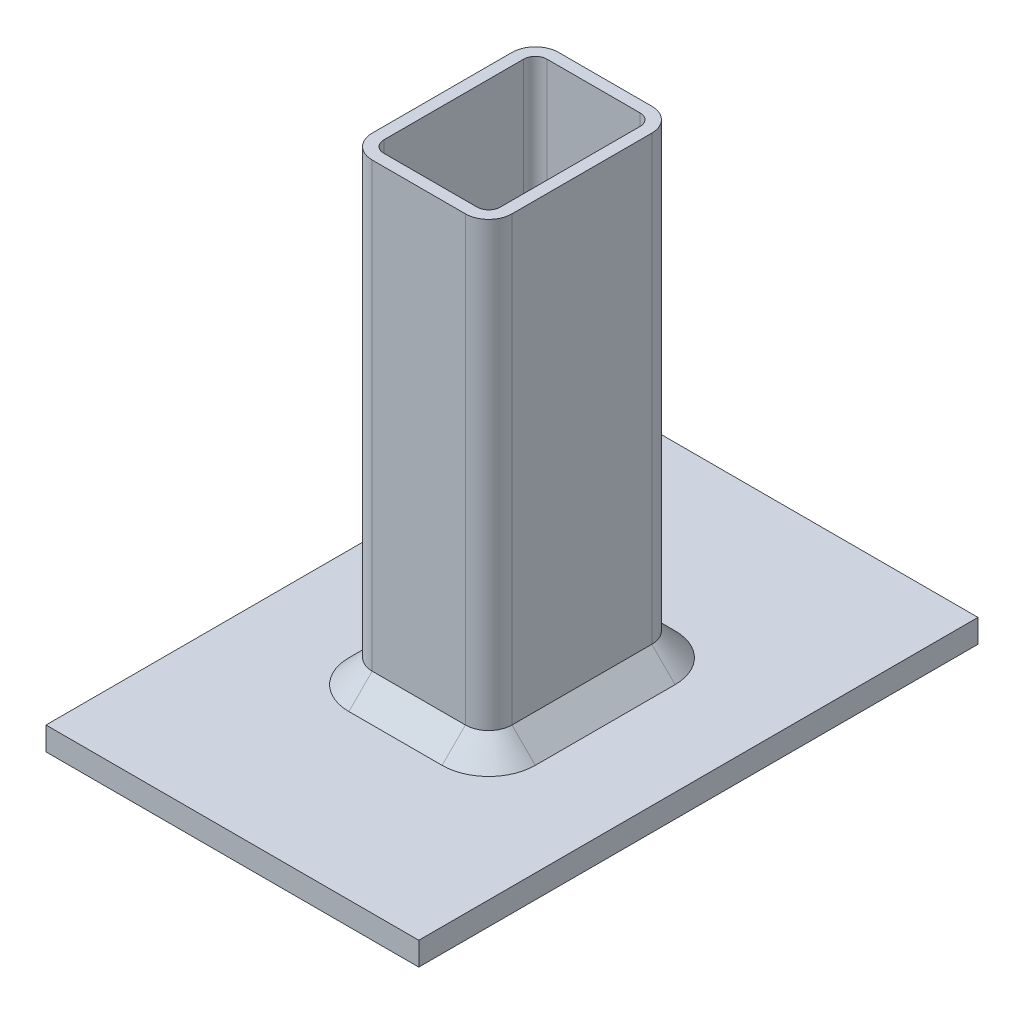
ISO-10303-21;
HEADER;
FILE_DESCRIPTION(('STEP AP214'),'2;1');
FILE_NAME('part.step','',(''),(''),'','','');
FILE_SCHEMA(('AUTOMOTIVE_DESIGN { 1 0 10303 214 1 1 1 1 }'));
ENDSEC;
DATA;
#1=APPLICATION_CONTEXT('core data for automotive mechanical design processes');
#2=APPLICATION_PROTOCOL_DEFINITION('international standard','automotive_design',2000,#1);
#3=PRODUCT_CONTEXT('',#1,'mechanical');
#4=PRODUCT('Part','Part','',(#3));
#5=PRODUCT_RELATED_PRODUCT_CATEGORY('part','',(#4));
#6=PRODUCT_DEFINITION_FORMATION('','',#4);
#7=PRODUCT_DEFINITION_CONTEXT('part definition',#1,'design');
#8=PRODUCT_DEFINITION('design','',#6,#7);
#9=PRODUCT_DEFINITION_SHAPE('','',#8);
#10=(LENGTH_UNIT() NAMED_UNIT(*) SI_UNIT(.MILLI.,.METRE.));
#11=(NAMED_UNIT(*) PLANE_ANGLE_UNIT() SI_UNIT($,.RADIAN.));
#12=(NAMED_UNIT(*) SI_UNIT($,.STERADIAN.) SOLID_ANGLE_UNIT());
#13=UNCERTAINTY_MEASURE_WITH_UNIT(LENGTH_MEASURE(1.E-05),#10,'distance_accuracy_value','');
#14=(GEOMETRIC_REPRESENTATION_CONTEXT(3) GLOBAL_UNCERTAINTY_ASSIGNED_CONTEXT((#13)) GLOBAL_UNIT_ASSIGNED_CONTEXT((#10,
#11,#12)) REPRESENTATION_CONTEXT('',''));
#15=CARTESIAN_POINT('',(0.,0.,0.));
#16=DIRECTION('',(0.,0.,1.));
#17=DIRECTION('',(1.,0.,0.));
#18=AXIS2_PLACEMENT_3D('',#15,#16,#17);
#19=CARTESIAN_POINT('',(38.1,12.7,-38.1));
#20=DIRECTION('',(0.707106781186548,0.707106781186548,0.));
#21=DIRECTION('',(-0.707106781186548,0.707106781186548,0.));
#22=AXIS2_PLACEMENT_3D('',#19,#20,#21);
#23=PLANE('',#22);
#24=DIRECTION('',(-0.707106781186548,0.707106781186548,0.));
#25=VECTOR('',#24,1.);
#26=CARTESIAN_POINT('',(50.8,0.,38.1));
#27=LINE('',#26,#25);
#28=CARTESIAN_POINT('',(50.8,0.,38.1));
#29=VERTEX_POINT('',#28);
#30=CARTESIAN_POINT('',(38.1,12.7,38.1));
#31=VERTEX_POINT('',#30);
#32=EDGE_CURVE('E232',#29,#31,#27,.T.);
#33=ORIENTED_EDGE('',*,*,#32,.F.);
#34=DIRECTION('',(0.,0.,1.));
#35=VECTOR('',#34,1.);
#36=CARTESIAN_POINT('',(50.8,0.,38.1));
#37=LINE('',#36,#35);
#38=CARTESIAN_POINT('',(50.8,0.,-38.1));
#39=VERTEX_POINT('',#38);
#40=EDGE_CURVE('E191',#39,#29,#37,.T.);
#41=ORIENTED_EDGE('',*,*,#40,.F.);
#42=DIRECTION('',(0.707106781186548,-0.707106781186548,0.));
#43=VECTOR('',#42,1.);
#44=CARTESIAN_POINT('',(38.1,12.7,-38.1));
#45=LINE('',#44,#43);
#46=CARTESIAN_POINT('',(38.1,12.7,-38.1));
#47=VERTEX_POINT('',#46);
#48=EDGE_CURVE('E53',#47,#39,#45,.T.);
#49=ORIENTED_EDGE('',*,*,#48,.F.);
#50=DIRECTION('',(0.,0.,-1.));
#51=VECTOR('',#50,1.);
#52=CARTESIAN_POINT('',(38.1,12.7,-38.1));
#53=LINE('',#52,#51);
#54=EDGE_CURVE('E12',#31,#47,#53,.T.);
#55=ORIENTED_EDGE('',*,*,#54,.F.);
#56=EDGE_LOOP('',(#33,#41,#49,#55));
#57=FACE_BOUND('',#56,.T.);
#58=ADVANCED_FACE('F50',(#57),#23,.T.);
#59=CARTESIAN_POINT('',(25.4,12.7,-38.1));
#60=DIRECTION('',(0.,-1.,0.));
#61=DIRECTION('',(0.,0.,-1.));
#62=AXIS2_PLACEMENT_3D('',#59,#60,#61);
#63=CONICAL_SURFACE('',#62,12.7,0.785398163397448);
#64=ORIENTED_EDGE('',*,*,#48,.T.);
#65=CARTESIAN_POINT('',(25.4,0.,-38.1));
#66=DIRECTION('',(0.,-1.,0.));
#67=DIRECTION('',(0.,0.,-1.));
#68=AXIS2_PLACEMENT_3D('',#65,#66,#67);
#69=CIRCLE('',#68,25.4);
#70=CARTESIAN_POINT('',(25.4,0.,-63.4999999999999));
#71=VERTEX_POINT('',#70);
#72=EDGE_CURVE('E193',#71,#39,#69,.T.);
#73=ORIENTED_EDGE('',*,*,#72,.F.);
#74=DIRECTION('',(0.,-0.707106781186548,-0.707106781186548));
#75=VECTOR('',#74,1.);
#76=CARTESIAN_POINT('',(25.4,12.7,-50.8));
#77=LINE('',#76,#75);
#78=CARTESIAN_POINT('',(25.4,12.7,-50.8));
#79=VERTEX_POINT('',#78);
#80=EDGE_CURVE('E230',#79,#71,#77,.T.);
#81=ORIENTED_EDGE('',*,*,#80,.F.);
#82=CARTESIAN_POINT('',(25.4,12.7,-38.1));
#83=DIRECTION('',(0.,-1.,0.));
#84=DIRECTION('',(0.,0.,-1.));
#85=AXIS2_PLACEMENT_3D('',#82,#83,#84);
#86=CIRCLE('',#85,12.7);
#87=EDGE_CURVE('E58',#47,#79,#86,.F.);
#88=ORIENTED_EDGE('',*,*,#87,.F.);
#89=EDGE_LOOP('',(#64,#73,#81,#88));
#90=FACE_BOUND('',#89,.T.);
#91=ADVANCED_FACE('F243',(#90),#63,.T.);
#92=CARTESIAN_POINT('',(25.4,12.7,38.1));
#93=DIRECTION('',(0.,-1.,0.));
#94=DIRECTION('',(0.,0.,-1.));
#95=AXIS2_PLACEMENT_3D('',#92,#93,#94);
#96=CONICAL_SURFACE('',#95,12.7,0.785398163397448);
#97=ORIENTED_EDGE('',*,*,#32,.T.);
#98=CARTESIAN_POINT('',(25.4,12.7,38.1));
#99=DIRECTION('',(0.,-1.,0.));
#100=DIRECTION('',(0.,0.,-1.));
#101=AXIS2_PLACEMENT_3D('',#98,#99,#100);
#102=CIRCLE('',#101,12.7);
#103=CARTESIAN_POINT('',(25.4,12.7,50.8));
#104=VERTEX_POINT('',#103);
#105=EDGE_CURVE('E214',#104,#31,#102,.F.);
#106=ORIENTED_EDGE('',*,*,#105,.F.);
#107=DIRECTION('',(0.,0.707106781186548,-0.707106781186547));
#108=VECTOR('',#107,1.);
#109=CARTESIAN_POINT('',(25.4,0.,63.4999999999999));
#110=LINE('',#109,#108);
#111=CARTESIAN_POINT('',(25.4,0.,63.5));
#112=VERTEX_POINT('',#111);
#113=EDGE_CURVE('E227',#112,#104,#110,.T.);
#114=ORIENTED_EDGE('',*,*,#113,.F.);
#115=CARTESIAN_POINT('',(25.4,0.,38.1));
#116=DIRECTION('',(0.,-1.,0.));
#117=DIRECTION('',(0.,0.,-1.));
#118=AXIS2_PLACEMENT_3D('',#115,#116,#117);
#119=CIRCLE('',#118,25.3999999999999);
#120=EDGE_CURVE('E195',#29,#112,#119,.T.);
#121=ORIENTED_EDGE('',*,*,#120,.F.);
#122=EDGE_LOOP('',(#97,#106,#114,#121));
#123=FACE_BOUND('',#122,.T.);
#124=ADVANCED_FACE('F278',(#123),#96,.T.);
#125=CARTESIAN_POINT('',(25.4,12.7,-50.8));
#126=DIRECTION('',(0.,0.707106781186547,-0.707106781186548));
#127=DIRECTION('',(0.,0.707106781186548,0.707106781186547));
#128=AXIS2_PLACEMENT_3D('',#125,#126,#127);
#129=PLANE('',#128);
#130=ORIENTED_EDGE('',*,*,#80,.T.);
#131=DIRECTION('',(1.,0.,0.));
#132=VECTOR('',#131,1.);
#133=CARTESIAN_POINT('',(25.4,0.,-63.4999999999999));
#134=LINE('',#133,#132);
#135=CARTESIAN_POINT('',(-25.4,0.,-63.4999999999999));
#136=VERTEX_POINT('',#135);
#137=EDGE_CURVE('E197',#136,#71,#134,.T.);
#138=ORIENTED_EDGE('',*,*,#137,.F.);
#139=DIRECTION('',(0.,-0.707106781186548,-0.707106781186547));
#140=VECTOR('',#139,1.);
#141=CARTESIAN_POINT('',(-25.4,12.7,-50.8));
#142=LINE('',#141,#140);
#143=CARTESIAN_POINT('',(-25.4,12.7,-50.8));
#144=VERTEX_POINT('',#143);
#145=EDGE_CURVE('E224',#144,#136,#142,.T.);
#146=ORIENTED_EDGE('',*,*,#145,.F.);
#147=DIRECTION('',(-1.,0.,0.));
#148=VECTOR('',#147,1.);
#149=CARTESIAN_POINT('',(-25.4,12.7,-50.8));
#150=LINE('',#149,#148);
#151=EDGE_CURVE('E212',#79,#144,#150,.T.);
#152=ORIENTED_EDGE('',*,*,#151,.F.);
#153=EDGE_LOOP('',(#130,#138,#146,#152));
#154=FACE_BOUND('',#153,.T.);
#155=ADVANCED_FACE('F253',(#154),#129,.T.);
#156=CARTESIAN_POINT('',(-25.4,12.7,50.8));
#157=DIRECTION('',(0.,0.707106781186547,0.707106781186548));
#158=DIRECTION('',(0.,-0.707106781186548,0.707106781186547));
#159=AXIS2_PLACEMENT_3D('',#156,#157,#158);
#160=PLANE('',#159);
#161=ORIENTED_EDGE('',*,*,#113,.T.);
#162=DIRECTION('',(1.,0.,0.));
#163=VECTOR('',#162,1.);
#164=CARTESIAN_POINT('',(25.4,12.7,50.8));
#165=LINE('',#164,#163);
#166=CARTESIAN_POINT('',(-25.4,12.7,50.8));
#167=VERTEX_POINT('',#166);
#168=EDGE_CURVE('E210',#167,#104,#165,.T.);
#169=ORIENTED_EDGE('',*,*,#168,.F.);
#170=DIRECTION('',(0.,0.707106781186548,-0.707106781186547));
#171=VECTOR('',#170,1.);
#172=CARTESIAN_POINT('',(-25.4,0.,63.5));
#173=LINE('',#172,#171);
#174=CARTESIAN_POINT('',(-25.4,0.,63.5));
#175=VERTEX_POINT('',#174);
#176=EDGE_CURVE('E221',#175,#167,#173,.T.);
#177=ORIENTED_EDGE('',*,*,#176,.F.);
#178=DIRECTION('',(-1.,0.,0.));
#179=VECTOR('',#178,1.);
#180=CARTESIAN_POINT('',(-25.4,0.,63.5));
#181=LINE('',#180,#179);
#182=EDGE_CURVE('E199',#112,#175,#181,.T.);
#183=ORIENTED_EDGE('',*,*,#182,.F.);
#184=EDGE_LOOP('',(#161,#169,#177,#183));
#185=FACE_BOUND('',#184,.T.);
#186=ADVANCED_FACE('F282',(#185),#160,.T.);
#187=CARTESIAN_POINT('',(-25.4,12.7,-38.1));
#188=DIRECTION('',(0.,-1.,0.));
#189=DIRECTION('',(0.,0.,-1.));
#190=AXIS2_PLACEMENT_3D('',#187,#188,#189);
#191=CONICAL_SURFACE('',#190,12.7,0.785398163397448);
#192=ORIENTED_EDGE('',*,*,#145,.T.);
#193=CARTESIAN_POINT('',(-25.4,0.,-38.1));
#194=DIRECTION('',(0.,-1.,0.));
#195=DIRECTION('',(0.,0.,-1.));
#196=AXIS2_PLACEMENT_3D('',#193,#194,#195);
#197=CIRCLE('',#196,25.3999999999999);
#198=CARTESIAN_POINT('',(-50.8,0.,-38.1));
#199=VERTEX_POINT('',#198);
#200=EDGE_CURVE('E201',#199,#136,#197,.T.);
#201=ORIENTED_EDGE('',*,*,#200,.F.);
#202=DIRECTION('',(-0.707106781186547,-0.707106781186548,0.));
#203=VECTOR('',#202,1.);
#204=CARTESIAN_POINT('',(-38.1,12.7,-38.1));
#205=LINE('',#204,#203);
#206=CARTESIAN_POINT('',(-38.1,12.7,-38.1));
#207=VERTEX_POINT('',#206);
#208=EDGE_CURVE('E218',#207,#199,#205,.T.);
#209=ORIENTED_EDGE('',*,*,#208,.F.);
#210=CARTESIAN_POINT('',(-25.4,12.7,-38.1));
#211=DIRECTION('',(0.,-1.,0.));
#212=DIRECTION('',(0.,0.,-1.));
#213=AXIS2_PLACEMENT_3D('',#210,#211,#212);
#214=CIRCLE('',#213,12.7);
#215=EDGE_CURVE('E208',#144,#207,#214,.F.);
#216=ORIENTED_EDGE('',*,*,#215,.F.);
#217=EDGE_LOOP('',(#192,#201,#209,#216));
#218=FACE_BOUND('',#217,.T.);
#219=ADVANCED_FACE('F257',(#218),#191,.T.);
#220=CARTESIAN_POINT('',(-25.4,12.7,38.1));
#221=DIRECTION('',(0.,-1.,0.));
#222=DIRECTION('',(0.,0.,-1.));
#223=AXIS2_PLACEMENT_3D('',#220,#221,#222);
#224=CONICAL_SURFACE('',#223,12.7,0.785398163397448);
#225=ORIENTED_EDGE('',*,*,#176,.T.);
#226=CARTESIAN_POINT('',(-25.4,12.7,38.1));
#227=DIRECTION('',(0.,-1.,0.));
#228=DIRECTION('',(0.,0.,-1.));
#229=AXIS2_PLACEMENT_3D('',#226,#227,#228);
#230=CIRCLE('',#229,12.7);
#231=CARTESIAN_POINT('',(-38.1,12.7,38.1));
#232=VERTEX_POINT('',#231);
#233=EDGE_CURVE('E206',#232,#167,#230,.F.);
#234=ORIENTED_EDGE('',*,*,#233,.F.);
#235=DIRECTION('',(0.707106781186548,0.707106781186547,0.));
#236=VECTOR('',#235,1.);
#237=CARTESIAN_POINT('',(-50.8,0.,38.1));
#238=LINE('',#237,#236);
#239=CARTESIAN_POINT('',(-50.8,0.,38.1));
#240=VERTEX_POINT('',#239);
#241=EDGE_CURVE('E156',#240,#232,#238,.T.);
#242=ORIENTED_EDGE('',*,*,#241,.F.);
#243=CARTESIAN_POINT('',(-25.4,0.,38.1));
#244=DIRECTION('',(0.,-1.,0.));
#245=DIRECTION('',(0.,0.,-1.));
#246=AXIS2_PLACEMENT_3D('',#243,#244,#245);
#247=CIRCLE('',#246,25.4);
#248=EDGE_CURVE('E66',#175,#240,#247,.T.);
#249=ORIENTED_EDGE('',*,*,#248,.F.);
#250=EDGE_LOOP('',(#225,#234,#242,#249));
#251=FACE_BOUND('',#250,.T.);
#252=ADVANCED_FACE('F287',(#251),#224,.T.);
#253=CARTESIAN_POINT('',(-38.1,12.7,38.1));
#254=DIRECTION('',(-0.707106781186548,0.707106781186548,0.));
#255=DIRECTION('',(-0.707106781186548,-0.707106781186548,0.));
#256=AXIS2_PLACEMENT_3D('',#253,#254,#255);
#257=PLANE('',#256);
#258=ORIENTED_EDGE('',*,*,#208,.T.);
#259=DIRECTION('',(0.,0.,-1.));
#260=VECTOR('',#259,1.);
#261=CARTESIAN_POINT('',(-50.8,0.,-38.1));
#262=LINE('',#261,#260);
#263=EDGE_CURVE('E204',#240,#199,#262,.T.);
#264=ORIENTED_EDGE('',*,*,#263,.F.);
#265=ORIENTED_EDGE('',*,*,#241,.T.);
#266=DIRECTION('',(0.,0.,1.));
#267=VECTOR('',#266,1.);
#268=CARTESIAN_POINT('',(-38.1,12.7,38.1));
#269=LINE('',#268,#267);
#270=EDGE_CURVE('E144',#207,#232,#269,.T.);
#271=ORIENTED_EDGE('',*,*,#270,.F.);
#272=EDGE_LOOP('',(#258,#264,#265,#271));
#273=FACE_BOUND('',#272,.T.);
#274=ADVANCED_FACE('F289',(#273),#257,.T.);
#275=CARTESIAN_POINT('',(38.1,254.,-38.1));
#276=DIRECTION('',(-1.,0.,0.));
#277=DIRECTION('',(0.,0.,1.));
#278=AXIS2_PLACEMENT_3D('',#275,#276,#277);
#279=PLANE('',#278);
#280=ORIENTED_EDGE('',*,*,#54,.T.);
#281=DIRECTION('',(0.,-1.,0.));
#282=VECTOR('',#281,1.);
#283=CARTESIAN_POINT('',(38.1,254.,-38.1));
#284=LINE('',#283,#282);
#285=CARTESIAN_POINT('',(38.1,0.,-38.1));
#286=VERTEX_POINT('',#285);
#287=EDGE_CURVE('E183',#47,#286,#284,.T.);
#288=ORIENTED_EDGE('',*,*,#287,.T.);
#289=DIRECTION('',(0.,0.,-1.));
#290=VECTOR('',#289,1.);
#291=CARTESIAN_POINT('',(38.1,0.,152.4));
#292=LINE('',#291,#290);
#293=CARTESIAN_POINT('',(38.1,0.,38.1));
#294=VERTEX_POINT('',#293);
#295=EDGE_CURVE('E173',#294,#286,#292,.T.);
#296=ORIENTED_EDGE('',*,*,#295,.F.);
#297=DIRECTION('',(0.,1.,0.));
#298=VECTOR('',#297,1.);
#299=CARTESIAN_POINT('',(38.1,254.,38.1));
#300=LINE('',#299,#298);
#301=EDGE_CURVE('E181',#31,#294,#300,.F.);
#302=ORIENTED_EDGE('',*,*,#301,.F.);
#303=EDGE_LOOP('',(#280,#288,#296,#302));
#304=FACE_BOUND('',#303,.T.);
#305=ADVANCED_FACE('F272',(#304),#279,.T.);
#306=CARTESIAN_POINT('',(25.4,254.,-38.1));
#307=DIRECTION('',(0.,-1.,0.));
#308=DIRECTION('',(0.,0.,-1.));
#309=AXIS2_PLACEMENT_3D('',#306,#307,#308);
#310=CYLINDRICAL_SURFACE('',#309,12.7);
#311=ORIENTED_EDGE('',*,*,#87,.T.);
#312=DIRECTION('',(0.,1.,0.));
#313=VECTOR('',#312,1.);
#314=CARTESIAN_POINT('',(25.4,254.,-50.8));
#315=LINE('',#314,#313);
#316=CARTESIAN_POINT('',(25.4,0.,-50.8));
#317=VERTEX_POINT('',#316);
#318=EDGE_CURVE('E185',#79,#317,#315,.F.);
#319=ORIENTED_EDGE('',*,*,#318,.T.);
#320=CARTESIAN_POINT('',(25.4,0.,-38.1));
#321=DIRECTION('',(0.,-1.,0.));
#322=DIRECTION('',(0.,0.,-1.));
#323=AXIS2_PLACEMENT_3D('',#320,#321,#322);
#324=CIRCLE('',#323,12.7);
#325=EDGE_CURVE('E170',#286,#317,#324,.F.);
#326=ORIENTED_EDGE('',*,*,#325,.F.);
#327=ORIENTED_EDGE('',*,*,#287,.F.);
#328=EDGE_LOOP('',(#311,#319,#326,#327));
#329=FACE_BOUND('',#328,.T.);
#330=ADVANCED_FACE('F268',(#329),#310,.F.);
#331=CARTESIAN_POINT('',(25.4,254.,38.1));
#332=DIRECTION('',(0.,-1.,0.));
#333=DIRECTION('',(0.,0.,-1.));
#334=AXIS2_PLACEMENT_3D('',#331,#332,#333);
#335=CYLINDRICAL_SURFACE('',#334,12.7);
#336=ORIENTED_EDGE('',*,*,#105,.T.);
#337=ORIENTED_EDGE('',*,*,#301,.T.);
#338=CARTESIAN_POINT('',(25.4,0.,38.1));
#339=DIRECTION('',(0.,-1.,0.));
#340=DIRECTION('',(0.,0.,-1.));
#341=AXIS2_PLACEMENT_3D('',#338,#339,#340);
#342=CIRCLE('',#341,12.7);
#343=CARTESIAN_POINT('',(25.4,0.,50.8));
#344=VERTEX_POINT('',#343);
#345=EDGE_CURVE('E176',#344,#294,#342,.F.);
#346=ORIENTED_EDGE('',*,*,#345,.F.);
#347=DIRECTION('',(0.,-1.,0.));
#348=VECTOR('',#347,1.);
#349=CARTESIAN_POINT('',(25.4,254.,50.8));
#350=LINE('',#349,#348);
#351=EDGE_CURVE('E166',#104,#344,#350,.T.);
#352=ORIENTED_EDGE('',*,*,#351,.F.);
#353=EDGE_LOOP('',(#336,#337,#346,#352));
#354=FACE_BOUND('',#353,.T.);
#355=ADVANCED_FACE('F276',(#354),#335,.F.);
#356=CARTESIAN_POINT('',(25.4,254.,-50.8));
#357=DIRECTION('',(0.,0.,1.));
#358=DIRECTION('',(1.,0.,0.));
#359=AXIS2_PLACEMENT_3D('',#356,#357,#358);
#360=PLANE('',#359);
#361=ORIENTED_EDGE('',*,*,#151,.T.);
#362=DIRECTION('',(0.,-1.,0.));
#363=VECTOR('',#362,1.);
#364=CARTESIAN_POINT('',(-25.4,254.,-50.8));
#365=LINE('',#364,#363);
#366=CARTESIAN_POINT('',(-25.4,0.,-50.8));
#367=VERTEX_POINT('',#366);
#368=EDGE_CURVE('E187',#144,#367,#365,.T.);
#369=ORIENTED_EDGE('',*,*,#368,.T.);
#370=DIRECTION('',(-1.,0.,0.));
#371=VECTOR('',#370,1.);
#372=CARTESIAN_POINT('',(101.6,0.,-50.8));
#373=LINE('',#372,#371);
#374=EDGE_CURVE('E164',#317,#367,#373,.T.);
#375=ORIENTED_EDGE('',*,*,#374,.F.);
#376=ORIENTED_EDGE('',*,*,#318,.F.);
#377=EDGE_LOOP('',(#361,#369,#375,#376));
#378=FACE_BOUND('',#377,.T.);
#379=ADVANCED_FACE('F264',(#378),#360,.T.);
#380=CARTESIAN_POINT('',(-25.4,254.,50.8));
#381=DIRECTION('',(0.,0.,-1.));
#382=DIRECTION('',(-1.,0.,0.));
#383=AXIS2_PLACEMENT_3D('',#380,#381,#382);
#384=PLANE('',#383);
#385=ORIENTED_EDGE('',*,*,#168,.T.);
#386=ORIENTED_EDGE('',*,*,#351,.T.);
#387=DIRECTION('',(1.,0.,0.));
#388=VECTOR('',#387,1.);
#389=CARTESIAN_POINT('',(101.6,0.,50.8));
#390=LINE('',#389,#388);
#391=CARTESIAN_POINT('',(-25.4,0.,50.8));
#392=VERTEX_POINT('',#391);
#393=EDGE_CURVE('E157',#392,#344,#390,.T.);
#394=ORIENTED_EDGE('',*,*,#393,.F.);
#395=DIRECTION('',(0.,1.,0.));
#396=VECTOR('',#395,1.);
#397=CARTESIAN_POINT('',(-25.4,254.,50.8));
#398=LINE('',#397,#396);
#399=EDGE_CURVE('E152',#167,#392,#398,.F.);
#400=ORIENTED_EDGE('',*,*,#399,.F.);
#401=EDGE_LOOP('',(#385,#386,#394,#400));
#402=FACE_BOUND('',#401,.T.);
#403=ADVANCED_FACE('F362',(#402),#384,.T.);
#404=CARTESIAN_POINT('',(101.6,0.,152.4));
#405=DIRECTION('',(0.,-1.,0.));
#406=DIRECTION('',(0.,0.,-1.));
#407=AXIS2_PLACEMENT_3D('',#404,#405,#406);
#408=PLANE('',#407);
#409=CARTESIAN_POINT('',(-25.4,0.,38.1));
#410=DIRECTION('',(0.,-1.,0.));
#411=DIRECTION('',(0.,0.,-1.));
#412=AXIS2_PLACEMENT_3D('',#409,#410,#411);
#413=CIRCLE('',#412,12.7);
#414=CARTESIAN_POINT('',(-38.1,0.,38.1));
#415=VERTEX_POINT('',#414);
#416=EDGE_CURVE('E149',#415,#392,#413,.F.);
#417=ORIENTED_EDGE('',*,*,#416,.T.);
#418=ORIENTED_EDGE('',*,*,#393,.T.);
#419=ORIENTED_EDGE('',*,*,#345,.T.);
#420=ORIENTED_EDGE('',*,*,#295,.T.);
#421=ORIENTED_EDGE('',*,*,#325,.T.);
#422=ORIENTED_EDGE('',*,*,#374,.T.);
#423=CARTESIAN_POINT('',(-25.4,0.,-38.1));
#424=DIRECTION('',(0.,-1.,0.));
#425=DIRECTION('',(0.,0.,-1.));
#426=AXIS2_PLACEMENT_3D('',#423,#424,#425);
#427=CIRCLE('',#426,12.7);
#428=CARTESIAN_POINT('',(-38.1,0.,-38.1));
#429=VERTEX_POINT('',#428);
#430=EDGE_CURVE('E162',#367,#429,#427,.F.);
#431=ORIENTED_EDGE('',*,*,#430,.T.);
#432=DIRECTION('',(0.,0.,1.));
#433=VECTOR('',#432,1.);
#434=CARTESIAN_POINT('',(-38.1,0.,152.4));
#435=LINE('',#434,#433);
#436=EDGE_CURVE('E141',#429,#415,#435,.T.);
#437=ORIENTED_EDGE('',*,*,#436,.T.);
#438=EDGE_LOOP('',(#417,#418,#419,#420,#421,#422,#431,#437));
#439=FACE_BOUND('',#438,.T.);
#440=ORIENTED_EDGE('',*,*,#40,.T.);
#441=ORIENTED_EDGE('',*,*,#120,.T.);
#442=ORIENTED_EDGE('',*,*,#182,.T.);
#443=ORIENTED_EDGE('',*,*,#248,.T.);
#444=ORIENTED_EDGE('',*,*,#263,.T.);
#445=ORIENTED_EDGE('',*,*,#200,.T.);
#446=ORIENTED_EDGE('',*,*,#137,.T.);
#447=ORIENTED_EDGE('',*,*,#72,.T.);
#448=EDGE_LOOP('',(#440,#441,#442,#443,#444,#445,#446,#447));
#449=FACE_BOUND('',#448,.T.);
#450=ADVANCED_FACE('F159',(#439,#449),#408,.T.);
#451=CARTESIAN_POINT('',(-25.4,254.,38.1));
#452=DIRECTION('',(0.,-1.,0.));
#453=DIRECTION('',(0.,0.,-1.));
#454=AXIS2_PLACEMENT_3D('',#451,#452,#453);
#455=CYLINDRICAL_SURFACE('',#454,12.7);
#456=ORIENTED_EDGE('',*,*,#233,.T.);
#457=ORIENTED_EDGE('',*,*,#399,.T.);
#458=ORIENTED_EDGE('',*,*,#416,.F.);
#459=DIRECTION('',(0.,-1.,0.));
#460=VECTOR('',#459,1.);
#461=CARTESIAN_POINT('',(-38.1,254.,38.1));
#462=LINE('',#461,#460);
#463=EDGE_CURVE('E137',#232,#415,#462,.T.);
#464=ORIENTED_EDGE('',*,*,#463,.F.);
#465=EDGE_LOOP('',(#456,#457,#458,#464));
#466=FACE_BOUND('',#465,.T.);
#467=ADVANCED_FACE('F150',(#466),#455,.F.);
#468=CARTESIAN_POINT('',(-25.4,254.,-38.1));
#469=DIRECTION('',(0.,-1.,0.));
#470=DIRECTION('',(0.,0.,-1.));
#471=AXIS2_PLACEMENT_3D('',#468,#469,#470);
#472=CYLINDRICAL_SURFACE('',#471,12.7);
#473=ORIENTED_EDGE('',*,*,#215,.T.);
#474=DIRECTION('',(0.,1.,0.));
#475=VECTOR('',#474,1.);
#476=CARTESIAN_POINT('',(-38.1,254.,-38.1));
#477=LINE('',#476,#475);
#478=EDGE_CURVE('E74',#207,#429,#477,.F.);
#479=ORIENTED_EDGE('',*,*,#478,.T.);
#480=ORIENTED_EDGE('',*,*,#430,.F.);
#481=ORIENTED_EDGE('',*,*,#368,.F.);
#482=EDGE_LOOP('',(#473,#479,#480,#481));
#483=FACE_BOUND('',#482,.T.);
#484=ADVANCED_FACE('F261',(#483),#472,.F.);
#485=CARTESIAN_POINT('',(-38.1,254.,38.1));
#486=DIRECTION('',(1.,0.,0.));
#487=DIRECTION('',(0.,0.,-1.));
#488=AXIS2_PLACEMENT_3D('',#485,#486,#487);
#489=PLANE('',#488);
#490=ORIENTED_EDGE('',*,*,#270,.T.);
#491=ORIENTED_EDGE('',*,*,#463,.T.);
#492=ORIENTED_EDGE('',*,*,#436,.F.);
#493=ORIENTED_EDGE('',*,*,#478,.F.);
#494=EDGE_LOOP('',(#490,#491,#492,#493));
#495=FACE_BOUND('',#494,.T.);
#496=ADVANCED_FACE('F139',(#495),#489,.T.);
#497=CLOSED_SHELL('',(#58,#91,#124,#155,#186,#219,#252,#274,#305,#330,#355,#379,#403,#450,#467,
#484,#496));
#498=MANIFOLD_SOLID_BREP('B2',#497);
#499=CARTESIAN_POINT('',(101.6,-12.7,-152.4));
#500=DIRECTION('',(-1.,0.,0.));
#501=DIRECTION('',(0.,0.,1.));
#502=AXIS2_PLACEMENT_3D('',#499,#500,#501);
#503=PLANE('',#502);
#504=DIRECTION('',(0.,0.,1.));
#505=VECTOR('',#504,1.);
#506=CARTESIAN_POINT('',(101.6,0.,-152.4));
#507=LINE('',#506,#505);
#508=CARTESIAN_POINT('',(101.6,0.,-152.4));
#509=VERTEX_POINT('',#508);
#510=CARTESIAN_POINT('',(101.6,0.,152.4));
#511=VERTEX_POINT('',#510);
#512=EDGE_CURVE('E533',#509,#511,#507,.T.);
#513=ORIENTED_EDGE('',*,*,#512,.T.);
#514=DIRECTION('',(0.,1.,0.));
#515=VECTOR('',#514,1.);
#516=CARTESIAN_POINT('',(101.6,-12.7,152.4));
#517=LINE('',#516,#515);
#518=CARTESIAN_POINT('',(101.6,-12.7,152.4));
#519=VERTEX_POINT('',#518);
#520=EDGE_CURVE('E48',#519,#511,#517,.T.);
#521=ORIENTED_EDGE('',*,*,#520,.F.);
#522=DIRECTION('',(0.,0.,1.));
#523=VECTOR('',#522,1.);
#524=CARTESIAN_POINT('',(101.6,-12.7,-152.4));
#525=LINE('',#524,#523);
#526=CARTESIAN_POINT('',(101.6,-12.7,-152.4));
#527=VERTEX_POINT('',#526);
#528=EDGE_CURVE('E521',#527,#519,#525,.T.);
#529=ORIENTED_EDGE('',*,*,#528,.F.);
#530=DIRECTION('',(0.,1.,0.));
#531=VECTOR('',#530,1.);
#532=CARTESIAN_POINT('',(101.6,-12.7,-152.4));
#533=LINE('',#532,#531);
#534=EDGE_CURVE('E529',#527,#509,#533,.T.);
#535=ORIENTED_EDGE('',*,*,#534,.T.);
#536=EDGE_LOOP('',(#513,#521,#529,#535));
#537=FACE_BOUND('',#536,.T.);
#538=ADVANCED_FACE('F470',(#537),#503,.F.);
#539=CARTESIAN_POINT('',(101.6,-12.7,152.4));
#540=DIRECTION('',(0.,0.,-1.));
#541=DIRECTION('',(-1.,0.,0.));
#542=AXIS2_PLACEMENT_3D('',#539,#540,#541);
#543=PLANE('',#542);
#544=DIRECTION('',(-1.,0.,0.));
#545=VECTOR('',#544,1.);
#546=CARTESIAN_POINT('',(101.6,0.,152.4));
#547=LINE('',#546,#545);
#548=CARTESIAN_POINT('',(-101.6,0.,152.4));
#549=VERTEX_POINT('',#548);
#550=EDGE_CURVE('E525',#511,#549,#547,.T.);
#551=ORIENTED_EDGE('',*,*,#550,.T.);
#552=DIRECTION('',(0.,1.,0.));
#553=VECTOR('',#552,1.);
#554=CARTESIAN_POINT('',(-101.6,-12.7,152.4));
#555=LINE('',#554,#553);
#556=CARTESIAN_POINT('',(-101.6,-12.7,152.4));
#557=VERTEX_POINT('',#556);
#558=EDGE_CURVE('E478',#557,#549,#555,.T.);
#559=ORIENTED_EDGE('',*,*,#558,.F.);
#560=DIRECTION('',(-1.,0.,0.));
#561=VECTOR('',#560,1.);
#562=CARTESIAN_POINT('',(101.6,-12.7,152.4));
#563=LINE('',#562,#561);
#564=EDGE_CURVE('E516',#519,#557,#563,.T.);
#565=ORIENTED_EDGE('',*,*,#564,.F.);
#566=ORIENTED_EDGE('',*,*,#520,.T.);
#567=EDGE_LOOP('',(#551,#559,#565,#566));
#568=FACE_BOUND('',#567,.T.);
#569=ADVANCED_FACE('F524',(#568),#543,.F.);
#570=CARTESIAN_POINT('',(-101.6,-12.7,-152.4));
#571=DIRECTION('',(1.,0.,0.));
#572=DIRECTION('',(0.,0.,-1.));
#573=AXIS2_PLACEMENT_3D('',#570,#571,#572);
#574=PLANE('',#573);
#575=DIRECTION('',(0.,0.,-1.));
#576=VECTOR('',#575,1.);
#577=CARTESIAN_POINT('',(-101.6,0.,-152.4));
#578=LINE('',#577,#576);
#579=CARTESIAN_POINT('',(-101.6,0.,-152.4));
#580=VERTEX_POINT('',#579);
#581=EDGE_CURVE('E503',#549,#580,#578,.T.);
#582=ORIENTED_EDGE('',*,*,#581,.T.);
#583=DIRECTION('',(0.,1.,0.));
#584=VECTOR('',#583,1.);
#585=CARTESIAN_POINT('',(-101.6,-12.7,-152.4));
#586=LINE('',#585,#584);
#587=CARTESIAN_POINT('',(-101.6,-12.7,-152.4));
#588=VERTEX_POINT('',#587);
#589=EDGE_CURVE('E526',#588,#580,#586,.T.);
#590=ORIENTED_EDGE('',*,*,#589,.F.);
#591=DIRECTION('',(0.,0.,-1.));
#592=VECTOR('',#591,1.);
#593=CARTESIAN_POINT('',(-101.6,-12.7,-152.4));
#594=LINE('',#593,#592);
#595=EDGE_CURVE('E519',#557,#588,#594,.T.);
#596=ORIENTED_EDGE('',*,*,#595,.F.);
#597=ORIENTED_EDGE('',*,*,#558,.T.);
#598=EDGE_LOOP('',(#582,#590,#596,#597));
#599=FACE_BOUND('',#598,.T.);
#600=ADVANCED_FACE('F527',(#599),#574,.F.);
#601=CARTESIAN_POINT('',(101.6,-12.7,-152.4));
#602=DIRECTION('',(0.,0.,1.));
#603=DIRECTION('',(1.,0.,0.));
#604=AXIS2_PLACEMENT_3D('',#601,#602,#603);
#605=PLANE('',#604);
#606=DIRECTION('',(1.,0.,0.));
#607=VECTOR('',#606,1.);
#608=CARTESIAN_POINT('',(101.6,0.,-152.4));
#609=LINE('',#608,#607);
#610=EDGE_CURVE('E509',#580,#509,#609,.T.);
#611=ORIENTED_EDGE('',*,*,#610,.T.);
#612=ORIENTED_EDGE('',*,*,#534,.F.);
#613=DIRECTION('',(1.,0.,0.));
#614=VECTOR('',#613,1.);
#615=CARTESIAN_POINT('',(101.6,-12.7,-152.4));
#616=LINE('',#615,#614);
#617=EDGE_CURVE('E486',#588,#527,#616,.T.);
#618=ORIENTED_EDGE('',*,*,#617,.F.);
#619=ORIENTED_EDGE('',*,*,#589,.T.);
#620=EDGE_LOOP('',(#611,#612,#618,#619));
#621=FACE_BOUND('',#620,.T.);
#622=ADVANCED_FACE('F540',(#621),#605,.F.);
#623=CARTESIAN_POINT('',(101.6,-12.7,152.4));
#624=DIRECTION('',(0.,-1.,0.));
#625=DIRECTION('',(0.,0.,-1.));
#626=AXIS2_PLACEMENT_3D('',#623,#624,#625);
#627=PLANE('',#626);
#628=ORIENTED_EDGE('',*,*,#528,.T.);
#629=ORIENTED_EDGE('',*,*,#564,.T.);
#630=ORIENTED_EDGE('',*,*,#595,.T.);
#631=ORIENTED_EDGE('',*,*,#617,.T.);
#632=EDGE_LOOP('',(#628,#629,#630,#631));
#633=FACE_BOUND('',#632,.T.);
#634=ADVANCED_FACE('F517',(#633),#627,.T.);
#635=CARTESIAN_POINT('',(101.6,0.,152.4));
#636=DIRECTION('',(0.,-1.,0.));
#637=DIRECTION('',(0.,0.,-1.));
#638=AXIS2_PLACEMENT_3D('',#635,#636,#637);
#639=PLANE('',#638);
#640=ORIENTED_EDGE('',*,*,#512,.F.);
#641=ORIENTED_EDGE('',*,*,#610,.F.);
#642=ORIENTED_EDGE('',*,*,#581,.F.);
#643=ORIENTED_EDGE('',*,*,#550,.F.);
#644=EDGE_LOOP('',(#640,#641,#642,#643));
#645=FACE_BOUND('',#644,.T.);
#646=ADVANCED_FACE('F543',(#645),#639,.F.);
#647=CLOSED_SHELL('',(#538,#569,#600,#622,#634,#646));
#648=MANIFOLD_SOLID_BREP('B6',#647);
#649=CARTESIAN_POINT('',(-25.4,254.,38.1));
#650=DIRECTION('',(0.,-1.,0.));
#651=DIRECTION('',(0.,0.,-1.));
#652=AXIS2_PLACEMENT_3D('',#649,#650,#651);
#653=CYLINDRICAL_SURFACE('',#652,12.7);
#654=CARTESIAN_POINT('',(-25.4,0.,38.1));
#655=DIRECTION('',(0.,1.,0.));
#656=DIRECTION('',(0.,0.,1.));
#657=AXIS2_PLACEMENT_3D('',#654,#655,#656);
#658=CIRCLE('',#657,12.7);
#659=CARTESIAN_POINT('',(-38.1,0.,38.1));
#660=VERTEX_POINT('',#659);
#661=CARTESIAN_POINT('',(-25.4,0.,50.8));
#662=VERTEX_POINT('',#661);
#663=EDGE_CURVE('E766',#660,#662,#658,.T.);
#664=ORIENTED_EDGE('',*,*,#663,.T.);
#665=DIRECTION('',(0.,-1.,0.));
#666=VECTOR('',#665,1.);
#667=CARTESIAN_POINT('',(-25.4,254.,50.8));
#668=LINE('',#667,#666);
#669=CARTESIAN_POINT('',(-25.4,254.,50.8));
#670=VERTEX_POINT('',#669);
#671=EDGE_CURVE('E468',#670,#662,#668,.T.);
#672=ORIENTED_EDGE('',*,*,#671,.F.);
#673=CARTESIAN_POINT('',(-25.4,254.,38.1));
#674=DIRECTION('',(0.,1.,0.));
#675=DIRECTION('',(0.,0.,1.));
#676=AXIS2_PLACEMENT_3D('',#673,#674,#675);
#677=CIRCLE('',#676,12.7);
#678=CARTESIAN_POINT('',(-38.1,254.,38.1));
#679=VERTEX_POINT('',#678);
#680=EDGE_CURVE('E844',#679,#670,#677,.T.);
#681=ORIENTED_EDGE('',*,*,#680,.F.);
#682=DIRECTION('',(0.,-1.,0.));
#683=VECTOR('',#682,1.);
#684=CARTESIAN_POINT('',(-38.1,254.,38.1));
#685=LINE('',#684,#683);
#686=EDGE_CURVE('E781',#679,#660,#685,.T.);
#687=ORIENTED_EDGE('',*,*,#686,.T.);
#688=EDGE_LOOP('',(#664,#672,#681,#687));
#689=FACE_BOUND('',#688,.T.);
#690=ADVANCED_FACE('F594',(#689),#653,.T.);
#691=CARTESIAN_POINT('',(-25.4,254.,50.8));
#692=DIRECTION('',(0.,0.,-1.));
#693=DIRECTION('',(-1.,0.,0.));
#694=AXIS2_PLACEMENT_3D('',#691,#692,#693);
#695=PLANE('',#694);
#696=DIRECTION('',(1.,0.,0.));
#697=VECTOR('',#696,1.);
#698=CARTESIAN_POINT('',(-25.4,0.,50.8));
#699=LINE('',#698,#697);
#700=CARTESIAN_POINT('',(25.4,0.,50.8));
#701=VERTEX_POINT('',#700);
#702=EDGE_CURVE('E769',#662,#701,#699,.T.);
#703=ORIENTED_EDGE('',*,*,#702,.T.);
#704=DIRECTION('',(0.,-1.,0.));
#705=VECTOR('',#704,1.);
#706=CARTESIAN_POINT('',(25.4,254.,50.8));
#707=LINE('',#706,#705);
#708=CARTESIAN_POINT('',(25.4,254.,50.8));
#709=VERTEX_POINT('',#708);
#710=EDGE_CURVE('E604',#709,#701,#707,.T.);
#711=ORIENTED_EDGE('',*,*,#710,.F.);
#712=DIRECTION('',(1.,0.,0.));
#713=VECTOR('',#712,1.);
#714=CARTESIAN_POINT('',(-25.4,254.,50.8));
#715=LINE('',#714,#713);
#716=EDGE_CURVE('E846',#670,#709,#715,.T.);
#717=ORIENTED_EDGE('',*,*,#716,.F.);
#718=ORIENTED_EDGE('',*,*,#671,.T.);
#719=EDGE_LOOP('',(#703,#711,#717,#718));
#720=FACE_BOUND('',#719,.T.);
#721=ADVANCED_FACE('F881',(#720),#695,.F.);
#722=CARTESIAN_POINT('',(25.4,254.,38.1));
#723=DIRECTION('',(0.,-1.,0.));
#724=DIRECTION('',(0.,0.,-1.));
#725=AXIS2_PLACEMENT_3D('',#722,#723,#724);
#726=CYLINDRICAL_SURFACE('',#725,12.7);
#727=CARTESIAN_POINT('',(25.4,0.,38.1));
#728=DIRECTION('',(0.,1.,0.));
#729=DIRECTION('',(0.,0.,1.));
#730=AXIS2_PLACEMENT_3D('',#727,#728,#729);
#731=CIRCLE('',#730,12.7);
#732=CARTESIAN_POINT('',(38.1,0.,38.1));
#733=VERTEX_POINT('',#732);
#734=EDGE_CURVE('E771',#701,#733,#731,.T.);
#735=ORIENTED_EDGE('',*,*,#734,.T.);
#736=DIRECTION('',(0.,-1.,0.));
#737=VECTOR('',#736,1.);
#738=CARTESIAN_POINT('',(38.1,254.,38.1));
#739=LINE('',#738,#737);
#740=CARTESIAN_POINT('',(38.1,254.,38.1));
#741=VERTEX_POINT('',#740);
#742=EDGE_CURVE('E788',#741,#733,#739,.T.);
#743=ORIENTED_EDGE('',*,*,#742,.F.);
#744=CARTESIAN_POINT('',(25.4,254.,38.1));
#745=DIRECTION('',(0.,1.,0.));
#746=DIRECTION('',(0.,0.,1.));
#747=AXIS2_PLACEMENT_3D('',#744,#745,#746);
#748=CIRCLE('',#747,12.7);
#749=EDGE_CURVE('E848',#709,#741,#748,.T.);
#750=ORIENTED_EDGE('',*,*,#749,.F.);
#751=ORIENTED_EDGE('',*,*,#710,.T.);
#752=EDGE_LOOP('',(#735,#743,#750,#751));
#753=FACE_BOUND('',#752,.T.);
#754=ADVANCED_FACE('F886',(#753),#726,.T.);
#755=CARTESIAN_POINT('',(38.1,254.,-38.1));
#756=DIRECTION('',(-1.,0.,0.));
#757=DIRECTION('',(0.,0.,1.));
#758=AXIS2_PLACEMENT_3D('',#755,#756,#757);
#759=PLANE('',#758);
#760=DIRECTION('',(0.,0.,-1.));
#761=VECTOR('',#760,1.);
#762=CARTESIAN_POINT('',(38.1,0.,-38.1));
#763=LINE('',#762,#761);
#764=CARTESIAN_POINT('',(38.1,0.,-38.1));
#765=VERTEX_POINT('',#764);
#766=EDGE_CURVE('E773',#733,#765,#763,.T.);
#767=ORIENTED_EDGE('',*,*,#766,.T.);
#768=DIRECTION('',(0.,-1.,0.));
#769=VECTOR('',#768,1.);
#770=CARTESIAN_POINT('',(38.1,254.,-38.1));
#771=LINE('',#770,#769);
#772=CARTESIAN_POINT('',(38.1,254.,-38.1));
#773=VERTEX_POINT('',#772);
#774=EDGE_CURVE('E785',#773,#765,#771,.T.);
#775=ORIENTED_EDGE('',*,*,#774,.F.);
#776=DIRECTION('',(0.,0.,-1.));
#777=VECTOR('',#776,1.);
#778=CARTESIAN_POINT('',(38.1,254.,-38.1));
#779=LINE('',#778,#777);
#780=EDGE_CURVE('E850',#741,#773,#779,.T.);
#781=ORIENTED_EDGE('',*,*,#780,.F.);
#782=ORIENTED_EDGE('',*,*,#742,.T.);
#783=EDGE_LOOP('',(#767,#775,#781,#782));
#784=FACE_BOUND('',#783,.T.);
#785=ADVANCED_FACE('F856',(#784),#759,.F.);
#786=CARTESIAN_POINT('',(25.4,254.,-38.1));
#787=DIRECTION('',(0.,-1.,0.));
#788=DIRECTION('',(0.,0.,-1.));
#789=AXIS2_PLACEMENT_3D('',#786,#787,#788);
#790=CYLINDRICAL_SURFACE('',#789,12.7);
#791=CARTESIAN_POINT('',(25.4,0.,-38.1));
#792=DIRECTION('',(0.,1.,0.));
#793=DIRECTION('',(0.,0.,1.));
#794=AXIS2_PLACEMENT_3D('',#791,#792,#793);
#795=CIRCLE('',#794,12.7);
#796=CARTESIAN_POINT('',(25.4,0.,-50.8));
#797=VERTEX_POINT('',#796);
#798=EDGE_CURVE('E775',#765,#797,#795,.T.);
#799=ORIENTED_EDGE('',*,*,#798,.T.);
#800=DIRECTION('',(0.,-1.,0.));
#801=VECTOR('',#800,1.);
#802=CARTESIAN_POINT('',(25.4,254.,-50.8));
#803=LINE('',#802,#801);
#804=CARTESIAN_POINT('',(25.4,254.,-50.8));
#805=VERTEX_POINT('',#804);
#806=EDGE_CURVE('E733',#805,#797,#803,.T.);
#807=ORIENTED_EDGE('',*,*,#806,.F.);
#808=CARTESIAN_POINT('',(25.4,254.,-38.1));
#809=DIRECTION('',(0.,1.,0.));
#810=DIRECTION('',(0.,0.,1.));
#811=AXIS2_PLACEMENT_3D('',#808,#809,#810);
#812=CIRCLE('',#811,12.7);
#813=EDGE_CURVE('E724',#773,#805,#812,.T.);
#814=ORIENTED_EDGE('',*,*,#813,.F.);
#815=ORIENTED_EDGE('',*,*,#774,.T.);
#816=EDGE_LOOP('',(#799,#807,#814,#815));
#817=FACE_BOUND('',#816,.T.);
#818=ADVANCED_FACE('F860',(#817),#790,.T.);
#819=CARTESIAN_POINT('',(25.4,254.,-50.8));
#820=DIRECTION('',(0.,0.,1.));
#821=DIRECTION('',(1.,0.,0.));
#822=AXIS2_PLACEMENT_3D('',#819,#820,#821);
#823=PLANE('',#822);
#824=DIRECTION('',(-1.,0.,0.));
#825=VECTOR('',#824,1.);
#826=CARTESIAN_POINT('',(25.4,0.,-50.8));
#827=LINE('',#826,#825);
#828=CARTESIAN_POINT('',(-25.4,0.,-50.8));
#829=VERTEX_POINT('',#828);
#830=EDGE_CURVE('E732',#797,#829,#827,.T.);
#831=ORIENTED_EDGE('',*,*,#830,.T.);
#832=DIRECTION('',(0.,-1.,0.));
#833=VECTOR('',#832,1.);
#834=CARTESIAN_POINT('',(-25.4,254.,-50.8));
#835=LINE('',#834,#833);
#836=CARTESIAN_POINT('',(-25.4,254.,-50.8));
#837=VERTEX_POINT('',#836);
#838=EDGE_CURVE('E729',#837,#829,#835,.T.);
#839=ORIENTED_EDGE('',*,*,#838,.F.);
#840=DIRECTION('',(-1.,0.,0.));
#841=VECTOR('',#840,1.);
#842=CARTESIAN_POINT('',(25.4,254.,-50.8));
#843=LINE('',#842,#841);
#844=EDGE_CURVE('E718',#805,#837,#843,.T.);
#845=ORIENTED_EDGE('',*,*,#844,.F.);
#846=ORIENTED_EDGE('',*,*,#806,.T.);
#847=EDGE_LOOP('',(#831,#839,#845,#846));
#848=FACE_BOUND('',#847,.T.);
#849=ADVANCED_FACE('F730',(#848),#823,.F.);
#850=CARTESIAN_POINT('',(-25.4,254.,-38.1));
#851=DIRECTION('',(0.,-1.,0.));
#852=DIRECTION('',(0.,0.,-1.));
#853=AXIS2_PLACEMENT_3D('',#850,#851,#852);
#854=CYLINDRICAL_SURFACE('',#853,12.7);
#855=CARTESIAN_POINT('',(-25.4,0.,-38.1));
#856=DIRECTION('',(0.,1.,0.));
#857=DIRECTION('',(0.,0.,1.));
#858=AXIS2_PLACEMENT_3D('',#855,#856,#857);
#859=CIRCLE('',#858,12.7);
#860=CARTESIAN_POINT('',(-38.1,0.,-38.1));
#861=VERTEX_POINT('',#860);
#862=EDGE_CURVE('E666',#829,#861,#859,.T.);
#863=ORIENTED_EDGE('',*,*,#862,.T.);
#864=DIRECTION('',(0.,-1.,0.));
#865=VECTOR('',#864,1.);
#866=CARTESIAN_POINT('',(-38.1,254.,-38.1));
#867=LINE('',#866,#865);
#868=CARTESIAN_POINT('',(-38.1,254.,-38.1));
#869=VERTEX_POINT('',#868);
#870=EDGE_CURVE('E734',#869,#861,#867,.T.);
#871=ORIENTED_EDGE('',*,*,#870,.F.);
#872=CARTESIAN_POINT('',(-25.4,254.,-38.1));
#873=DIRECTION('',(0.,1.,0.));
#874=DIRECTION('',(0.,0.,1.));
#875=AXIS2_PLACEMENT_3D('',#872,#873,#874);
#876=CIRCLE('',#875,12.7);
#877=EDGE_CURVE('E722',#837,#869,#876,.T.);
#878=ORIENTED_EDGE('',*,*,#877,.F.);
#879=ORIENTED_EDGE('',*,*,#838,.T.);
#880=EDGE_LOOP('',(#863,#871,#878,#879));
#881=FACE_BOUND('',#880,.T.);
#882=ADVANCED_FACE('F736',(#881),#854,.T.);
#883=CARTESIAN_POINT('',(25.4,254.,38.1));
#884=DIRECTION('',(0.,-1.,0.));
#885=DIRECTION('',(0.,0.,-1.));
#886=AXIS2_PLACEMENT_3D('',#883,#884,#885);
#887=CYLINDRICAL_SURFACE('',#886,6.34999999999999);
#888=CARTESIAN_POINT('',(25.4,0.,38.1));
#889=DIRECTION('',(0.,1.,0.));
#890=DIRECTION('',(0.,0.,1.));
#891=AXIS2_PLACEMENT_3D('',#888,#889,#890);
#892=CIRCLE('',#891,6.34999999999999);
#893=CARTESIAN_POINT('',(25.4,0.,44.45));
#894=VERTEX_POINT('',#893);
#895=CARTESIAN_POINT('',(31.75,0.,38.1));
#896=VERTEX_POINT('',#895);
#897=EDGE_CURVE('E742',#894,#896,#892,.T.);
#898=ORIENTED_EDGE('',*,*,#897,.F.);
#899=DIRECTION('',(0.,-1.,0.));
#900=VECTOR('',#899,1.);
#901=CARTESIAN_POINT('',(25.4,254.,44.45));
#902=LINE('',#901,#900);
#903=CARTESIAN_POINT('',(25.4,254.,44.45));
#904=VERTEX_POINT('',#903);
#905=EDGE_CURVE('E598',#904,#894,#902,.T.);
#906=ORIENTED_EDGE('',*,*,#905,.F.);
#907=CARTESIAN_POINT('',(25.4,254.,38.1));
#908=DIRECTION('',(0.,1.,0.));
#909=DIRECTION('',(0.,0.,1.));
#910=AXIS2_PLACEMENT_3D('',#907,#908,#909);
#911=CIRCLE('',#910,6.34999999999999);
#912=CARTESIAN_POINT('',(31.75,254.,38.1));
#913=VERTEX_POINT('',#912);
#914=EDGE_CURVE('E780',#904,#913,#911,.T.);
#915=ORIENTED_EDGE('',*,*,#914,.T.);
#916=DIRECTION('',(0.,-1.,0.));
#917=VECTOR('',#916,1.);
#918=CARTESIAN_POINT('',(31.75,254.,38.1));
#919=LINE('',#918,#917);
#920=EDGE_CURVE('E738',#913,#896,#919,.T.);
#921=ORIENTED_EDGE('',*,*,#920,.T.);
#922=EDGE_LOOP('',(#898,#906,#915,#921));
#923=FACE_BOUND('',#922,.T.);
#924=ADVANCED_FACE('F596',(#923),#887,.F.);
#925=CARTESIAN_POINT('',(-25.4,254.,44.45));
#926=DIRECTION('',(0.,0.,-1.));
#927=DIRECTION('',(-1.,0.,0.));
#928=AXIS2_PLACEMENT_3D('',#925,#926,#927);
#929=PLANE('',#928);
#930=DIRECTION('',(1.,0.,0.));
#931=VECTOR('',#930,1.);
#932=CARTESIAN_POINT('',(-25.4,0.,44.45));
#933=LINE('',#932,#931);
#934=CARTESIAN_POINT('',(-25.4,0.,44.45));
#935=VERTEX_POINT('',#934);
#936=EDGE_CURVE('E745',#935,#894,#933,.T.);
#937=ORIENTED_EDGE('',*,*,#936,.F.);
#938=DIRECTION('',(0.,-1.,0.));
#939=VECTOR('',#938,1.);
#940=CARTESIAN_POINT('',(-25.4,254.,44.45));
#941=LINE('',#940,#939);
#942=CARTESIAN_POINT('',(-25.4,254.,44.45));
#943=VERTEX_POINT('',#942);
#944=EDGE_CURVE('E803',#943,#935,#941,.T.);
#945=ORIENTED_EDGE('',*,*,#944,.F.);
#946=DIRECTION('',(1.,0.,0.));
#947=VECTOR('',#946,1.);
#948=CARTESIAN_POINT('',(-25.4,254.,44.45));
#949=LINE('',#948,#947);
#950=EDGE_CURVE('E812',#943,#904,#949,.T.);
#951=ORIENTED_EDGE('',*,*,#950,.T.);
#952=ORIENTED_EDGE('',*,*,#905,.T.);
#953=EDGE_LOOP('',(#937,#945,#951,#952));
#954=FACE_BOUND('',#953,.T.);
#955=ADVANCED_FACE('F810',(#954),#929,.T.);
#956=CARTESIAN_POINT('',(-25.4,254.,38.1));
#957=DIRECTION('',(0.,-1.,0.));
#958=DIRECTION('',(0.,0.,-1.));
#959=AXIS2_PLACEMENT_3D('',#956,#957,#958);
#960=CYLINDRICAL_SURFACE('',#959,6.34999999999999);
#961=CARTESIAN_POINT('',(-25.4,0.,38.1));
#962=DIRECTION('',(0.,1.,0.));
#963=DIRECTION('',(0.,0.,1.));
#964=AXIS2_PLACEMENT_3D('',#961,#962,#963);
#965=CIRCLE('',#964,6.34999999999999);
#966=CARTESIAN_POINT('',(-31.75,0.,38.1));
#967=VERTEX_POINT('',#966);
#968=EDGE_CURVE('E748',#967,#935,#965,.T.);
#969=ORIENTED_EDGE('',*,*,#968,.F.);
#970=DIRECTION('',(0.,-1.,0.));
#971=VECTOR('',#970,1.);
#972=CARTESIAN_POINT('',(-31.75,254.,38.1));
#973=LINE('',#972,#971);
#974=CARTESIAN_POINT('',(-31.75,254.,38.1));
#975=VERTEX_POINT('',#974);
#976=EDGE_CURVE('E802',#975,#967,#973,.T.);
#977=ORIENTED_EDGE('',*,*,#976,.F.);
#978=CARTESIAN_POINT('',(-25.4,254.,38.1));
#979=DIRECTION('',(0.,1.,0.));
#980=DIRECTION('',(0.,0.,1.));
#981=AXIS2_PLACEMENT_3D('',#978,#979,#980);
#982=CIRCLE('',#981,6.34999999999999);
#983=EDGE_CURVE('E820',#975,#943,#982,.T.);
#984=ORIENTED_EDGE('',*,*,#983,.T.);
#985=ORIENTED_EDGE('',*,*,#944,.T.);
#986=EDGE_LOOP('',(#969,#977,#984,#985));
#987=FACE_BOUND('',#986,.T.);
#988=ADVANCED_FACE('F818',(#987),#960,.F.);
#989=CARTESIAN_POINT('',(-31.75,254.,38.1));
#990=DIRECTION('',(1.,0.,0.));
#991=DIRECTION('',(0.,0.,-1.));
#992=AXIS2_PLACEMENT_3D('',#989,#990,#991);
#993=PLANE('',#992);
#994=DIRECTION('',(0.,0.,1.));
#995=VECTOR('',#994,1.);
#996=CARTESIAN_POINT('',(-31.75,0.,38.1));
#997=LINE('',#996,#995);
#998=CARTESIAN_POINT('',(-31.75,0.,-38.1));
#999=VERTEX_POINT('',#998);
#1000=EDGE_CURVE('E751',#999,#967,#997,.T.);
#1001=ORIENTED_EDGE('',*,*,#1000,.F.);
#1002=DIRECTION('',(0.,-1.,0.));
#1003=VECTOR('',#1002,1.);
#1004=CARTESIAN_POINT('',(-31.75,254.,-38.1));
#1005=LINE('',#1004,#1003);
#1006=CARTESIAN_POINT('',(-31.75,254.,-38.1));
#1007=VERTEX_POINT('',#1006);
#1008=EDGE_CURVE('E800',#1007,#999,#1005,.T.);
#1009=ORIENTED_EDGE('',*,*,#1008,.F.);
#1010=DIRECTION('',(0.,0.,1.));
#1011=VECTOR('',#1010,1.);
#1012=CARTESIAN_POINT('',(-31.75,254.,38.1));
#1013=LINE('',#1012,#1011);
#1014=EDGE_CURVE('E826',#1007,#975,#1013,.T.);
#1015=ORIENTED_EDGE('',*,*,#1014,.T.);
#1016=ORIENTED_EDGE('',*,*,#976,.T.);
#1017=EDGE_LOOP('',(#1001,#1009,#1015,#1016));
#1018=FACE_BOUND('',#1017,.T.);
#1019=ADVANCED_FACE('F829',(#1018),#993,.T.);
#1020=CARTESIAN_POINT('',(-25.4,254.,-38.1));
#1021=DIRECTION('',(0.,-1.,0.));
#1022=DIRECTION('',(0.,0.,-1.));
#1023=AXIS2_PLACEMENT_3D('',#1020,#1021,#1022);
#1024=CYLINDRICAL_SURFACE('',#1023,6.34999999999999);
#1025=CARTESIAN_POINT('',(-25.4,0.,-38.1));
#1026=DIRECTION('',(0.,1.,0.));
#1027=DIRECTION('',(0.,0.,1.));
#1028=AXIS2_PLACEMENT_3D('',#1025,#1026,#1027);
#1029=CIRCLE('',#1028,6.34999999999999);
#1030=CARTESIAN_POINT('',(-25.4,0.,-44.45));
#1031=VERTEX_POINT('',#1030);
#1032=EDGE_CURVE('E754',#1031,#999,#1029,.T.);
#1033=ORIENTED_EDGE('',*,*,#1032,.F.);
#1034=DIRECTION('',(0.,-1.,0.));
#1035=VECTOR('',#1034,1.);
#1036=CARTESIAN_POINT('',(-25.4,254.,-44.45));
#1037=LINE('',#1036,#1035);
#1038=CARTESIAN_POINT('',(-25.4,254.,-44.45));
#1039=VERTEX_POINT('',#1038);
#1040=EDGE_CURVE('E798',#1039,#1031,#1037,.T.);
#1041=ORIENTED_EDGE('',*,*,#1040,.F.);
#1042=CARTESIAN_POINT('',(-25.4,254.,-38.1));
#1043=DIRECTION('',(0.,1.,0.));
#1044=DIRECTION('',(0.,0.,1.));
#1045=AXIS2_PLACEMENT_3D('',#1042,#1043,#1044);
#1046=CIRCLE('',#1045,6.34999999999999);
#1047=EDGE_CURVE('E830',#1039,#1007,#1046,.T.);
#1048=ORIENTED_EDGE('',*,*,#1047,.T.);
#1049=ORIENTED_EDGE('',*,*,#1008,.T.);
#1050=EDGE_LOOP('',(#1033,#1041,#1048,#1049));
#1051=FACE_BOUND('',#1050,.T.);
#1052=ADVANCED_FACE('F897',(#1051),#1024,.F.);
#1053=CARTESIAN_POINT('',(25.4,254.,-44.45));
#1054=DIRECTION('',(0.,0.,1.));
#1055=DIRECTION('',(1.,0.,0.));
#1056=AXIS2_PLACEMENT_3D('',#1053,#1054,#1055);
#1057=PLANE('',#1056);
#1058=DIRECTION('',(-1.,0.,0.));
#1059=VECTOR('',#1058,1.);
#1060=CARTESIAN_POINT('',(25.4,0.,-44.45));
#1061=LINE('',#1060,#1059);
#1062=CARTESIAN_POINT('',(25.4,0.,-44.45));
#1063=VERTEX_POINT('',#1062);
#1064=EDGE_CURVE('E757',#1063,#1031,#1061,.T.);
#1065=ORIENTED_EDGE('',*,*,#1064,.F.);
#1066=DIRECTION('',(0.,-1.,0.));
#1067=VECTOR('',#1066,1.);
#1068=CARTESIAN_POINT('',(25.4,254.,-44.45));
#1069=LINE('',#1068,#1067);
#1070=CARTESIAN_POINT('',(25.4,254.,-44.45));
#1071=VERTEX_POINT('',#1070);
#1072=EDGE_CURVE('E796',#1071,#1063,#1069,.T.);
#1073=ORIENTED_EDGE('',*,*,#1072,.F.);
#1074=DIRECTION('',(-1.,0.,0.));
#1075=VECTOR('',#1074,1.);
#1076=CARTESIAN_POINT('',(25.4,254.,-44.45));
#1077=LINE('',#1076,#1075);
#1078=EDGE_CURVE('E832',#1071,#1039,#1077,.T.);
#1079=ORIENTED_EDGE('',*,*,#1078,.T.);
#1080=ORIENTED_EDGE('',*,*,#1040,.T.);
#1081=EDGE_LOOP('',(#1065,#1073,#1079,#1080));
#1082=FACE_BOUND('',#1081,.T.);
#1083=ADVANCED_FACE('F893',(#1082),#1057,.T.);
#1084=CARTESIAN_POINT('',(25.4,254.,-38.1));
#1085=DIRECTION('',(0.,-1.,0.));
#1086=DIRECTION('',(0.,0.,-1.));
#1087=AXIS2_PLACEMENT_3D('',#1084,#1085,#1086);
#1088=CYLINDRICAL_SURFACE('',#1087,6.34999999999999);
#1089=CARTESIAN_POINT('',(25.4,0.,-38.1));
#1090=DIRECTION('',(0.,1.,0.));
#1091=DIRECTION('',(0.,0.,1.));
#1092=AXIS2_PLACEMENT_3D('',#1089,#1090,#1091);
#1093=CIRCLE('',#1092,6.34999999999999);
#1094=CARTESIAN_POINT('',(31.75,0.,-38.1));
#1095=VERTEX_POINT('',#1094);
#1096=EDGE_CURVE('E760',#1095,#1063,#1093,.T.);
#1097=ORIENTED_EDGE('',*,*,#1096,.F.);
#1098=DIRECTION('',(0.,-1.,0.));
#1099=VECTOR('',#1098,1.);
#1100=CARTESIAN_POINT('',(31.75,254.,-38.1));
#1101=LINE('',#1100,#1099);
#1102=CARTESIAN_POINT('',(31.75,254.,-38.1));
#1103=VERTEX_POINT('',#1102);
#1104=EDGE_CURVE('E794',#1103,#1095,#1101,.T.);
#1105=ORIENTED_EDGE('',*,*,#1104,.F.);
#1106=CARTESIAN_POINT('',(25.4,254.,-38.1));
#1107=DIRECTION('',(0.,1.,0.));
#1108=DIRECTION('',(0.,0.,1.));
#1109=AXIS2_PLACEMENT_3D('',#1106,#1107,#1108);
#1110=CIRCLE('',#1109,6.34999999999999);
#1111=EDGE_CURVE('E838',#1103,#1071,#1110,.T.);
#1112=ORIENTED_EDGE('',*,*,#1111,.T.);
#1113=ORIENTED_EDGE('',*,*,#1072,.T.);
#1114=EDGE_LOOP('',(#1097,#1105,#1112,#1113));
#1115=FACE_BOUND('',#1114,.T.);
#1116=ADVANCED_FACE('F875',(#1115),#1088,.F.);
#1117=CARTESIAN_POINT('',(31.75,254.,-38.1));
#1118=DIRECTION('',(-1.,0.,0.));
#1119=DIRECTION('',(0.,0.,1.));
#1120=AXIS2_PLACEMENT_3D('',#1117,#1118,#1119);
#1121=PLANE('',#1120);
#1122=DIRECTION('',(0.,0.,-1.));
#1123=VECTOR('',#1122,1.);
#1124=CARTESIAN_POINT('',(31.75,0.,-38.1));
#1125=LINE('',#1124,#1123);
#1126=EDGE_CURVE('E763',#896,#1095,#1125,.T.);
#1127=ORIENTED_EDGE('',*,*,#1126,.F.);
#1128=ORIENTED_EDGE('',*,*,#920,.F.);
#1129=DIRECTION('',(0.,0.,-1.));
#1130=VECTOR('',#1129,1.);
#1131=CARTESIAN_POINT('',(31.75,254.,-38.1));
#1132=LINE('',#1131,#1130);
#1133=EDGE_CURVE('E841',#913,#1103,#1132,.T.);
#1134=ORIENTED_EDGE('',*,*,#1133,.T.);
#1135=ORIENTED_EDGE('',*,*,#1104,.T.);
#1136=EDGE_LOOP('',(#1127,#1128,#1134,#1135));
#1137=FACE_BOUND('',#1136,.T.);
#1138=ADVANCED_FACE('F868',(#1137),#1121,.T.);
#1139=CARTESIAN_POINT('',(-38.1,254.,38.1));
#1140=DIRECTION('',(1.,0.,0.));
#1141=DIRECTION('',(0.,0.,-1.));
#1142=AXIS2_PLACEMENT_3D('',#1139,#1140,#1141);
#1143=PLANE('',#1142);
#1144=DIRECTION('',(0.,0.,1.));
#1145=VECTOR('',#1144,1.);
#1146=CARTESIAN_POINT('',(-38.1,0.,38.1));
#1147=LINE('',#1146,#1145);
#1148=EDGE_CURVE('E672',#861,#660,#1147,.T.);
#1149=ORIENTED_EDGE('',*,*,#1148,.T.);
#1150=ORIENTED_EDGE('',*,*,#686,.F.);
#1151=DIRECTION('',(0.,0.,1.));
#1152=VECTOR('',#1151,1.);
#1153=CARTESIAN_POINT('',(-38.1,254.,38.1));
#1154=LINE('',#1153,#1152);
#1155=EDGE_CURVE('E613',#869,#679,#1154,.T.);
#1156=ORIENTED_EDGE('',*,*,#1155,.F.);
#1157=ORIENTED_EDGE('',*,*,#870,.T.);
#1158=EDGE_LOOP('',(#1149,#1150,#1156,#1157));
#1159=FACE_BOUND('',#1158,.T.);
#1160=ADVANCED_FACE('F866',(#1159),#1143,.F.);
#1161=CARTESIAN_POINT('',(-25.4,254.,38.1));
#1162=DIRECTION('',(0.,1.,0.));
#1163=DIRECTION('',(0.,0.,1.));
#1164=AXIS2_PLACEMENT_3D('',#1161,#1162,#1163);
#1165=PLANE('',#1164);
#1166=ORIENTED_EDGE('',*,*,#914,.F.);
#1167=ORIENTED_EDGE('',*,*,#950,.F.);
#1168=ORIENTED_EDGE('',*,*,#983,.F.);
#1169=ORIENTED_EDGE('',*,*,#1014,.F.);
#1170=ORIENTED_EDGE('',*,*,#1047,.F.);
#1171=ORIENTED_EDGE('',*,*,#1078,.F.);
#1172=ORIENTED_EDGE('',*,*,#1111,.F.);
#1173=ORIENTED_EDGE('',*,*,#1133,.F.);
#1174=EDGE_LOOP('',(#1166,#1167,#1168,#1169,#1170,#1171,#1172,#1173));
#1175=FACE_BOUND('',#1174,.T.);
#1176=ORIENTED_EDGE('',*,*,#680,.T.);
#1177=ORIENTED_EDGE('',*,*,#716,.T.);
#1178=ORIENTED_EDGE('',*,*,#749,.T.);
#1179=ORIENTED_EDGE('',*,*,#780,.T.);
#1180=ORIENTED_EDGE('',*,*,#813,.T.);
#1181=ORIENTED_EDGE('',*,*,#844,.T.);
#1182=ORIENTED_EDGE('',*,*,#877,.T.);
#1183=ORIENTED_EDGE('',*,*,#1155,.T.);
#1184=EDGE_LOOP('',(#1176,#1177,#1178,#1179,#1180,#1181,#1182,#1183));
#1185=FACE_BOUND('',#1184,.T.);
#1186=ADVANCED_FACE('F720',(#1175,#1185),#1165,.T.);
#1187=CARTESIAN_POINT('',(-25.4,0.,38.1));
#1188=DIRECTION('',(0.,1.,0.));
#1189=DIRECTION('',(0.,0.,1.));
#1190=AXIS2_PLACEMENT_3D('',#1187,#1188,#1189);
#1191=PLANE('',#1190);
#1192=ORIENTED_EDGE('',*,*,#897,.T.);
#1193=ORIENTED_EDGE('',*,*,#1126,.T.);
#1194=ORIENTED_EDGE('',*,*,#1096,.T.);
#1195=ORIENTED_EDGE('',*,*,#1064,.T.);
#1196=ORIENTED_EDGE('',*,*,#1032,.T.);
#1197=ORIENTED_EDGE('',*,*,#1000,.T.);
#1198=ORIENTED_EDGE('',*,*,#968,.T.);
#1199=ORIENTED_EDGE('',*,*,#936,.T.);
#1200=EDGE_LOOP('',(#1192,#1193,#1194,#1195,#1196,#1197,#1198,#1199));
#1201=FACE_BOUND('',#1200,.T.);
#1202=ORIENTED_EDGE('',*,*,#663,.F.);
#1203=ORIENTED_EDGE('',*,*,#1148,.F.);
#1204=ORIENTED_EDGE('',*,*,#862,.F.);
#1205=ORIENTED_EDGE('',*,*,#830,.F.);
#1206=ORIENTED_EDGE('',*,*,#798,.F.);
#1207=ORIENTED_EDGE('',*,*,#766,.F.);
#1208=ORIENTED_EDGE('',*,*,#734,.F.);
#1209=ORIENTED_EDGE('',*,*,#702,.F.);
#1210=EDGE_LOOP('',(#1202,#1203,#1204,#1205,#1206,#1207,#1208,#1209));
#1211=FACE_BOUND('',#1210,.T.);
#1212=ADVANCED_FACE('F815',(#1201,#1211),#1191,.F.);
#1213=CLOSED_SHELL('',(#690,#721,#754,#785,#818,#849,#882,#924,#955,#988,#1019,#1052,#1083,
#1116,#1138,#1160,#1186,#1212));
#1214=MANIFOLD_SOLID_BREP('B42',#1213);
#1215=ADVANCED_BREP_SHAPE_REPRESENTATION('',(#18,#498,#648,#1214),#14);
#1216=SHAPE_DEFINITION_REPRESENTATION(#9,#1215);
ENDSEC;
END-ISO-10303-21;
